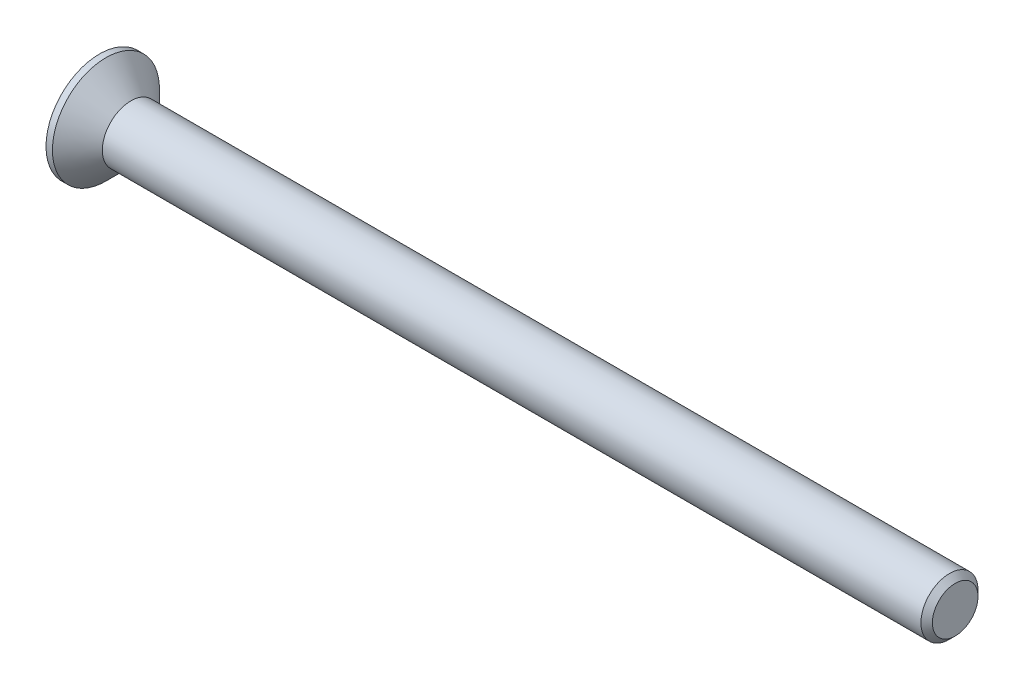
from build123d import *

# Parameters (mm, degrees)
CHAMFER1_SIZE      = 0.4
CUT_EXTRUDE1_DEPTH = 1.9


with BuildPart() as part:
    # Sketch1 → Revolve1 (revolve)
    with BuildSketch(Plane.XY, mode=Mode.PRIVATE) as revolve1_sk:
        Polygon((-2.2, 3.75), (-2.2, 0), (57.8, 0), (57.8, 2), (0, 2), (-1.75, 3.75), align=None)
    revolve(revolve1_sk.sketch.rotate(Axis((-2.2, 0, 0), (1, 0, 0)), 90), axis=Axis((-2.2, 0, 0), (1, 0, 0)))

    # Chamfer1
    chamfer1_edges = [part.edges().sort_by_distance(p)[0] for p in [
        (57.8, 0, -2),
    ]]
    chamfer(chamfer1_edges, length=CHAMFER1_SIZE)

    # Sketch2 → Cut-Extrude1 (cut)
    with BuildSketch(Plane.ZY.offset(2.2)):
        Polygon((-0.55, 2.2), (0.55, 2.2), (0.55, 0.55), (2.2, 0.55), (2.2, -0.55), (0.55, -0.55), (0.55, -2.2), (-0.55, -2.2), (-0.55, -0.55), (-2.2, -0.55), (-2.2, 0.55), (-0.55, 0.55), align=None)
    extrude(amount=-CUT_EXTRUDE1_DEPTH, mode=Mode.SUBTRACT)


solid = part.part
